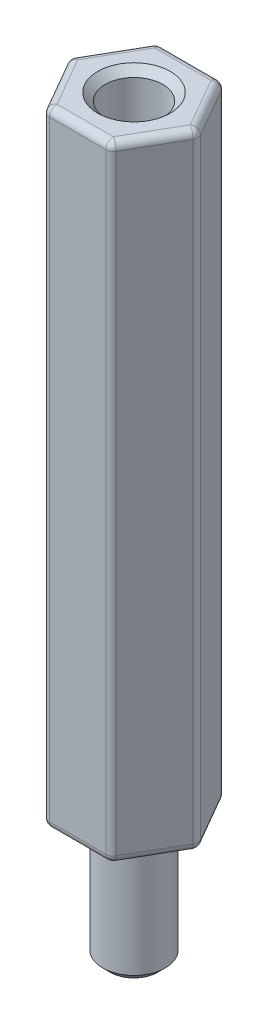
from build123d import *

# Parameters (mm, degrees)
SKETCH1_R           = 1.15
BOSS_EXTRUDE1_DEPTH = 25
FILLET1_R           = 0.3
FILLET2_R           = 0.3
SKETCH2_R           = 1.25
BOSS_EXTRUDE2_DEPTH = 5
CHAMFER1_SIZE       = 0.3
FILLET3_R           = 0.3


with BuildPart() as part:
    # Sketch1 → Boss-Extrude1 (new body)
    with BuildSketch(Plane(origin=(0, 0, 0), x_dir=(1, 0, 0), z_dir=(0, 1, 0))):
        Polygon((-1.299038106, 2.25), (-2.598076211, 0), (-1.299038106, -2.25), (1.299038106, -2.25), (2.598076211, 0), (1.299038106, 2.25), align=None)
        with Locations(Location((0, 0, 0), (0, 0, 270))):
            Circle(SKETCH1_R, mode=Mode.SUBTRACT)
    extrude(amount=BOSS_EXTRUDE1_DEPTH)

    # Fillet1
    fillet1_edges = [part.edges().sort_by_distance(p)[0] for p in [
        (1.299038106, 12.5, -2.25),
        (2.598076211, 12.5, 0),
        (1.299038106, 12.5, 2.25),
        (-1.299038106, 12.5, 2.25),
        (-2.598076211, 12.5, 0),
        (-1.299038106, 12.5, -2.25),
    ]]
    fillet(fillet1_edges, radius=FILLET1_R)

    # Fillet2
    fillet2_edges = [part.edges().sort_by_distance(p)[0] for p in [
        (0, 0, -2.25),
        (0, 25, -2.25),
        (1.948557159, 0, -1.125),
        (1.948557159, 0, 1.125),
        (0, 0, 2.25),
        (-1.948557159, 0, 1.125),
        (-1.948557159, 0, -1.125),
        (1.275833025, 0, 2.209807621),
        (-1.275833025, 0, 2.209807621),
        (-2.55166605, 0, 0),
        (-1.275833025, 0, -2.209807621),
        (2.55166605, 0, 0),
        (1.275833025, 0, -2.209807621),
        (1.948557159, 25, -1.125),
        (-1.948557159, 25, -1.125),
        (-1.948557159, 25, 1.125),
        (0, 25, 2.25),
        (1.948557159, 25, 1.125),
        (1.275833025, 25, 2.209807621),
        (-1.275833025, 25, 2.209807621),
        (-2.55166605, 25, 0),
        (-1.275833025, 25, -2.209807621),
        (2.55166605, 25, 0),
        (1.275833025, 25, -2.209807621),
    ]]
    fillet(fillet2_edges, radius=FILLET2_R)

    # Sketch2 → Boss-Extrude2 (add)
    with BuildSketch(Plane.XZ):
        with Locations(Location((0, 0, 0), (0, 0, 90))):
            Circle(SKETCH2_R)
    extrude(amount=BOSS_EXTRUDE2_DEPTH)

    # Chamfer1
    chamfer1_edges = [part.edges().sort_by_distance(p)[0] for p in [
        (0, -5, -1.25),
        (0, 25, -1.15),
    ]]
    chamfer(chamfer1_edges, length=CHAMFER1_SIZE)

    # Fillet3
    fillet3_edges = [part.edges().sort_by_distance(p)[0] for p in [
        (0, 0, -1.25),
    ]]
    fillet(fillet3_edges, radius=FILLET3_R)


solid = part.part
